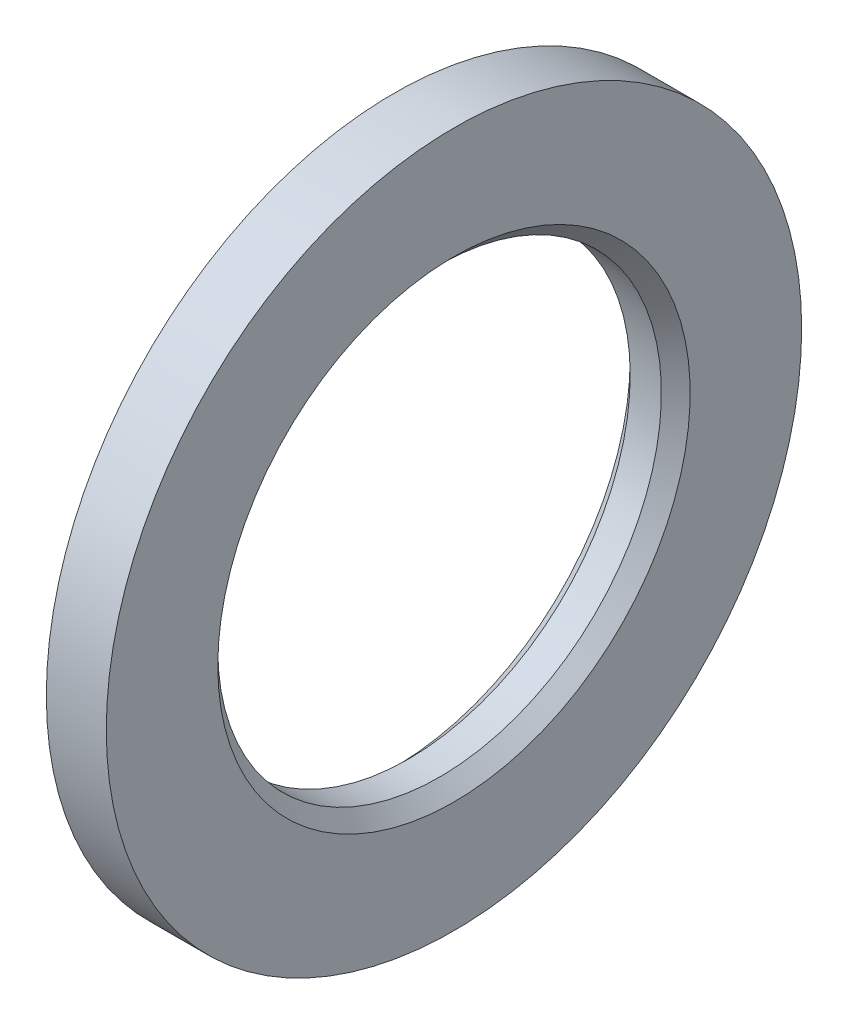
from build123d import *

# Parameters (mm, degrees)
SKETCH1_W         = 5
SKETCH1_H         = 10.5
IDCHAMFER_SIZE    = 1.2
IDCHAMFERFAR_SIZE = 1.2


with BuildPart() as part:
    # Sketch1 → Base-Revolve (revolve)
    with BuildSketch(Plane.XY, mode=Mode.PRIVATE) as base_revolve_sk:
        with Locations((-2.5, 23.75)):
            Rectangle(SKETCH1_W, SKETCH1_H)
    revolve(base_revolve_sk.sketch.rotate(Axis((-34.925, 0, 0), (1, 0, 0)), 90), axis=Axis((-34.925, 0, 0), (1, 0, 0)))

    # IDChamfer
    idchamfer_edges = [part.edges().sort_by_distance(p)[0] for p in [
        (0, 0, -18.5),
    ]]
    chamfer(idchamfer_edges, length=IDCHAMFER_SIZE)

    # IDChamferFar
    idchamferfar_edges = [part.edges().sort_by_distance(p)[0] for p in [
        (-5, 0, -18.5),
    ]]
    chamfer(idchamferfar_edges, length=IDCHAMFERFAR_SIZE)


solid = part.part
